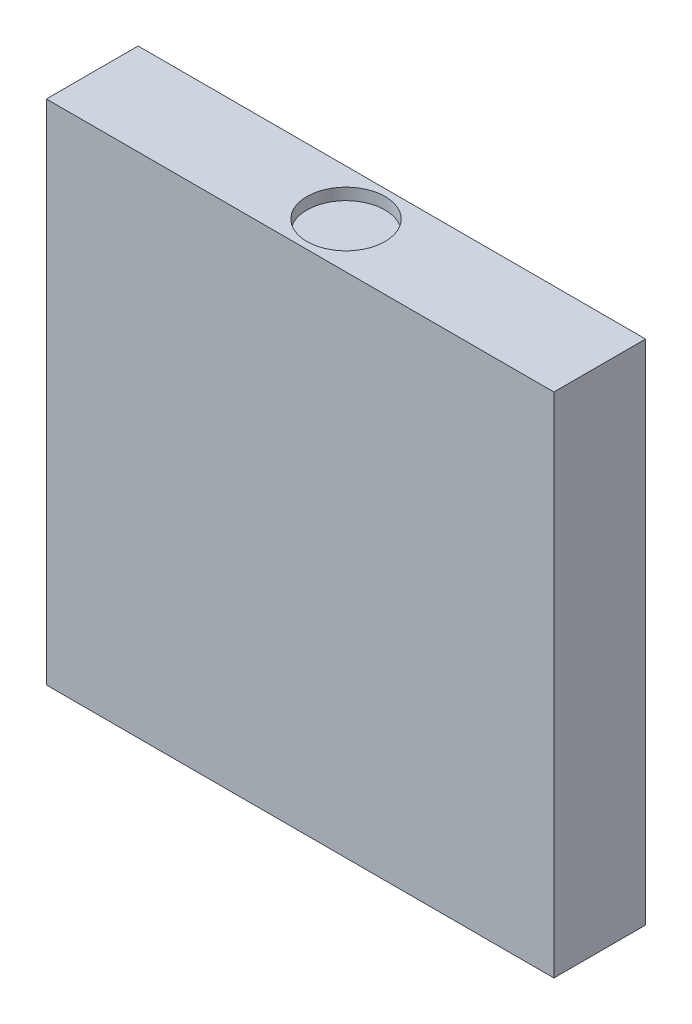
ISO-10303-21;
HEADER;
FILE_DESCRIPTION(('STEP AP214'),'2;1');
FILE_NAME('part.step','',(''),(''),'','','');
FILE_SCHEMA(('AUTOMOTIVE_DESIGN { 1 0 10303 214 1 1 1 1 }'));
ENDSEC;
DATA;
#1=APPLICATION_CONTEXT('core data for automotive mechanical design processes');
#2=APPLICATION_PROTOCOL_DEFINITION('international standard','automotive_design',2000,#1);
#3=PRODUCT_CONTEXT('',#1,'mechanical');
#4=PRODUCT('Part','Part','',(#3));
#5=PRODUCT_RELATED_PRODUCT_CATEGORY('part','',(#4));
#6=PRODUCT_DEFINITION_FORMATION('','',#4);
#7=PRODUCT_DEFINITION_CONTEXT('part definition',#1,'design');
#8=PRODUCT_DEFINITION('design','',#6,#7);
#9=PRODUCT_DEFINITION_SHAPE('','',#8);
#10=(LENGTH_UNIT() NAMED_UNIT(*) SI_UNIT(.MILLI.,.METRE.));
#11=(NAMED_UNIT(*) PLANE_ANGLE_UNIT() SI_UNIT($,.RADIAN.));
#12=(NAMED_UNIT(*) SI_UNIT($,.STERADIAN.) SOLID_ANGLE_UNIT());
#13=UNCERTAINTY_MEASURE_WITH_UNIT(LENGTH_MEASURE(1.E-05),#10,'distance_accuracy_value','');
#14=(GEOMETRIC_REPRESENTATION_CONTEXT(3) GLOBAL_UNCERTAINTY_ASSIGNED_CONTEXT((#13)) GLOBAL_UNIT_ASSIGNED_CONTEXT((#10,
#11,#12)) REPRESENTATION_CONTEXT('',''));
#15=CARTESIAN_POINT('',(0.,0.,0.));
#16=DIRECTION('',(0.,0.,1.));
#17=DIRECTION('',(1.,0.,0.));
#18=AXIS2_PLACEMENT_3D('',#15,#16,#17);
#19=CARTESIAN_POINT('',(0.,127.,0.));
#20=DIRECTION('',(0.,1.,0.));
#21=DIRECTION('',(0.,0.,1.));
#22=AXIS2_PLACEMENT_3D('',#19,#20,#21);
#23=PLANE('',#22);
#24=CARTESIAN_POINT('',(65.,127.,11.75));
#25=DIRECTION('',(0.,1.,0.));
#26=DIRECTION('',(0.,0.,1.));
#27=AXIS2_PLACEMENT_3D('',#24,#25,#26);
#28=CIRCLE('',#27,10.);
#29=CARTESIAN_POINT('',(65.,127.,21.75));
#30=VERTEX_POINT('',#29);
#31=EDGE_CURVE('E20',#30,#30,#28,.T.);
#32=ORIENTED_EDGE('',*,*,#31,.T.);
#33=EDGE_LOOP('',(#32));
#34=FACE_BOUND('',#33,.T.);
#35=ADVANCED_FACE('F17',(#34),#23,.T.);
#36=CARTESIAN_POINT('',(65.,128.5,11.75));
#37=DIRECTION('',(0.,1.,0.));
#38=DIRECTION('',(0.,0.,1.));
#39=AXIS2_PLACEMENT_3D('',#36,#37,#38);
#40=CYLINDRICAL_SURFACE('',#39,10.);
#41=CARTESIAN_POINT('',(65.,130.,11.75));
#42=DIRECTION('',(0.,1.,0.));
#43=DIRECTION('',(0.,0.,1.));
#44=AXIS2_PLACEMENT_3D('',#41,#42,#43);
#45=CIRCLE('',#44,10.);
#46=CARTESIAN_POINT('',(65.,130.,21.75));
#47=VERTEX_POINT('',#46);
#48=EDGE_CURVE('E79',#47,#47,#45,.F.);
#49=ORIENTED_EDGE('',*,*,#48,.F.);
#50=EDGE_LOOP('',(#49));
#51=FACE_BOUND('',#50,.T.);
#52=ORIENTED_EDGE('',*,*,#31,.F.);
#53=EDGE_LOOP('',(#52));
#54=FACE_BOUND('',#53,.T.);
#55=ADVANCED_FACE('F115',(#51,#54),#40,.F.);
#56=CARTESIAN_POINT('',(0.,0.,23.5));
#57=DIRECTION('',(0.,0.,1.));
#58=DIRECTION('',(1.,0.,0.));
#59=AXIS2_PLACEMENT_3D('',#56,#57,#58);
#60=PLANE('',#59);
#61=DIRECTION('',(1.,0.,0.));
#62=VECTOR('',#61,1.);
#63=CARTESIAN_POINT('',(130.,130.,23.5));
#64=LINE('',#63,#62);
#65=CARTESIAN_POINT('',(0.,130.,23.5));
#66=VERTEX_POINT('',#65);
#67=CARTESIAN_POINT('',(130.,130.,23.5));
#68=VERTEX_POINT('',#67);
#69=EDGE_CURVE('E81',#66,#68,#64,.T.);
#70=ORIENTED_EDGE('',*,*,#69,.F.);
#71=DIRECTION('',(0.,1.,0.));
#72=VECTOR('',#71,1.);
#73=CARTESIAN_POINT('',(0.,130.,23.5));
#74=LINE('',#73,#72);
#75=CARTESIAN_POINT('',(0.,0.,23.5));
#76=VERTEX_POINT('',#75);
#77=EDGE_CURVE('E60',#76,#66,#74,.T.);
#78=ORIENTED_EDGE('',*,*,#77,.F.);
#79=DIRECTION('',(1.,0.,0.));
#80=VECTOR('',#79,1.);
#81=CARTESIAN_POINT('',(0.,0.,23.5));
#82=LINE('',#81,#80);
#83=CARTESIAN_POINT('',(130.,0.,23.5));
#84=VERTEX_POINT('',#83);
#85=EDGE_CURVE('E58',#84,#76,#82,.F.);
#86=ORIENTED_EDGE('',*,*,#85,.F.);
#87=DIRECTION('',(0.,1.,0.));
#88=VECTOR('',#87,1.);
#89=CARTESIAN_POINT('',(130.,0.,23.5));
#90=LINE('',#89,#88);
#91=EDGE_CURVE('E55',#68,#84,#90,.F.);
#92=ORIENTED_EDGE('',*,*,#91,.F.);
#93=EDGE_LOOP('',(#70,#78,#86,#92));
#94=FACE_BOUND('',#93,.T.);
#95=ADVANCED_FACE('F59',(#94),#60,.T.);
#96=CARTESIAN_POINT('',(0.,0.,0.));
#97=DIRECTION('',(0.,-1.,0.));
#98=DIRECTION('',(0.,0.,-1.));
#99=AXIS2_PLACEMENT_3D('',#96,#97,#98);
#100=PLANE('',#99);
#101=DIRECTION('',(0.,0.,-1.));
#102=VECTOR('',#101,1.);
#103=CARTESIAN_POINT('',(130.,0.,0.));
#104=LINE('',#103,#102);
#105=CARTESIAN_POINT('',(130.,0.,0.));
#106=VERTEX_POINT('',#105);
#107=EDGE_CURVE('E65',#84,#106,#104,.T.);
#108=ORIENTED_EDGE('',*,*,#107,.F.);
#109=ORIENTED_EDGE('',*,*,#85,.T.);
#110=DIRECTION('',(0.,0.,1.));
#111=VECTOR('',#110,1.);
#112=CARTESIAN_POINT('',(0.,0.,0.));
#113=LINE('',#112,#111);
#114=CARTESIAN_POINT('',(0.,0.,0.));
#115=VERTEX_POINT('',#114);
#116=EDGE_CURVE('E84',#115,#76,#113,.T.);
#117=ORIENTED_EDGE('',*,*,#116,.F.);
#118=DIRECTION('',(1.,0.,0.));
#119=VECTOR('',#118,1.);
#120=CARTESIAN_POINT('',(0.,0.,0.));
#121=LINE('',#120,#119);
#122=EDGE_CURVE('E76',#115,#106,#121,.T.);
#123=ORIENTED_EDGE('',*,*,#122,.T.);
#124=EDGE_LOOP('',(#108,#109,#117,#123));
#125=FACE_BOUND('',#124,.T.);
#126=ADVANCED_FACE('F75',(#125),#100,.T.);
#127=CARTESIAN_POINT('',(130.,0.,0.));
#128=DIRECTION('',(1.,0.,0.));
#129=DIRECTION('',(0.,0.,-1.));
#130=AXIS2_PLACEMENT_3D('',#127,#128,#129);
#131=PLANE('',#130);
#132=DIRECTION('',(0.,0.,1.));
#133=VECTOR('',#132,1.);
#134=CARTESIAN_POINT('',(130.,130.,0.));
#135=LINE('',#134,#133);
#136=CARTESIAN_POINT('',(130.,130.,0.));
#137=VERTEX_POINT('',#136);
#138=EDGE_CURVE('E72',#68,#137,#135,.F.);
#139=ORIENTED_EDGE('',*,*,#138,.F.);
#140=ORIENTED_EDGE('',*,*,#91,.T.);
#141=ORIENTED_EDGE('',*,*,#107,.T.);
#142=DIRECTION('',(0.,1.,0.));
#143=VECTOR('',#142,1.);
#144=CARTESIAN_POINT('',(130.,0.,0.));
#145=LINE('',#144,#143);
#146=EDGE_CURVE('E92',#106,#137,#145,.T.);
#147=ORIENTED_EDGE('',*,*,#146,.T.);
#148=EDGE_LOOP('',(#139,#140,#141,#147));
#149=FACE_BOUND('',#148,.T.);
#150=ADVANCED_FACE('F69',(#149),#131,.T.);
#151=CARTESIAN_POINT('',(130.,130.,0.));
#152=DIRECTION('',(0.,1.,0.));
#153=DIRECTION('',(0.,0.,1.));
#154=AXIS2_PLACEMENT_3D('',#151,#152,#153);
#155=PLANE('',#154);
#156=ORIENTED_EDGE('',*,*,#48,.T.);
#157=EDGE_LOOP('',(#156));
#158=FACE_BOUND('',#157,.T.);
#159=DIRECTION('',(0.,0.,1.));
#160=VECTOR('',#159,1.);
#161=CARTESIAN_POINT('',(0.,130.,0.));
#162=LINE('',#161,#160);
#163=CARTESIAN_POINT('',(0.,130.,0.));
#164=VERTEX_POINT('',#163);
#165=EDGE_CURVE('E34',#66,#164,#162,.F.);
#166=ORIENTED_EDGE('',*,*,#165,.F.);
#167=ORIENTED_EDGE('',*,*,#69,.T.);
#168=ORIENTED_EDGE('',*,*,#138,.T.);
#169=DIRECTION('',(1.,0.,0.));
#170=VECTOR('',#169,1.);
#171=CARTESIAN_POINT('',(0.,130.,0.));
#172=LINE('',#171,#170);
#173=EDGE_CURVE('E26',#137,#164,#172,.F.);
#174=ORIENTED_EDGE('',*,*,#173,.T.);
#175=EDGE_LOOP('',(#166,#167,#168,#174));
#176=FACE_BOUND('',#175,.T.);
#177=ADVANCED_FACE('F96',(#158,#176),#155,.T.);
#178=CARTESIAN_POINT('',(0.,130.,0.));
#179=DIRECTION('',(-1.,0.,0.));
#180=DIRECTION('',(0.,0.,1.));
#181=AXIS2_PLACEMENT_3D('',#178,#179,#180);
#182=PLANE('',#181);
#183=ORIENTED_EDGE('',*,*,#116,.T.);
#184=ORIENTED_EDGE('',*,*,#77,.T.);
#185=ORIENTED_EDGE('',*,*,#165,.T.);
#186=DIRECTION('',(0.,1.,0.));
#187=VECTOR('',#186,1.);
#188=CARTESIAN_POINT('',(0.,0.,0.));
#189=LINE('',#188,#187);
#190=EDGE_CURVE('E11',#164,#115,#189,.F.);
#191=ORIENTED_EDGE('',*,*,#190,.T.);
#192=EDGE_LOOP('',(#183,#184,#185,#191));
#193=FACE_BOUND('',#192,.T.);
#194=ADVANCED_FACE('F99',(#193),#182,.T.);
#195=CARTESIAN_POINT('',(0.,0.,0.));
#196=DIRECTION('',(0.,0.,1.));
#197=DIRECTION('',(1.,0.,0.));
#198=AXIS2_PLACEMENT_3D('',#195,#196,#197);
#199=PLANE('',#198);
#200=ORIENTED_EDGE('',*,*,#173,.F.);
#201=ORIENTED_EDGE('',*,*,#146,.F.);
#202=ORIENTED_EDGE('',*,*,#122,.F.);
#203=ORIENTED_EDGE('',*,*,#190,.F.);
#204=EDGE_LOOP('',(#200,#201,#202,#203));
#205=FACE_BOUND('',#204,.T.);
#206=ADVANCED_FACE('F98',(#205),#199,.F.);
#207=CLOSED_SHELL('',(#35,#55,#95,#126,#150,#177,#194,#206));
#208=MANIFOLD_SOLID_BREP('B1',#207);
#209=ADVANCED_BREP_SHAPE_REPRESENTATION('',(#18,#208),#14);
#210=SHAPE_DEFINITION_REPRESENTATION(#9,#209);
ENDSEC;
END-ISO-10303-21;
